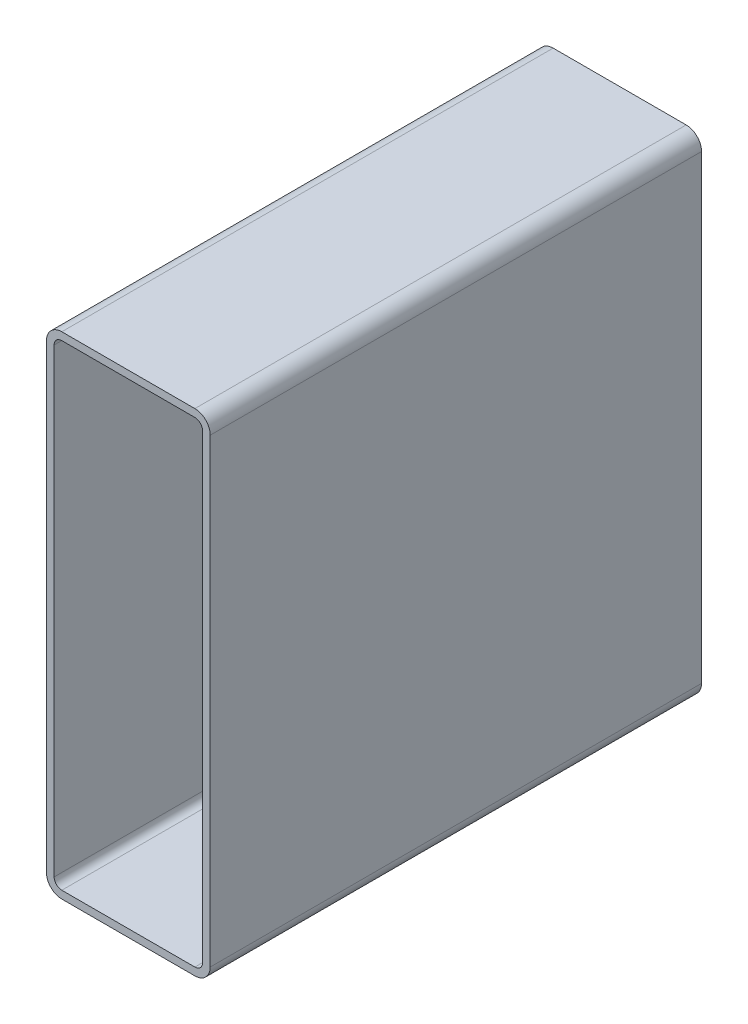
ISO-10303-21;
HEADER;
FILE_DESCRIPTION(('STEP AP214'),'2;1');
FILE_NAME('part.step','',(''),(''),'','','');
FILE_SCHEMA(('AUTOMOTIVE_DESIGN { 1 0 10303 214 1 1 1 1 }'));
ENDSEC;
DATA;
#1=APPLICATION_CONTEXT('core data for automotive mechanical design processes');
#2=APPLICATION_PROTOCOL_DEFINITION('international standard','automotive_design',2000,#1);
#3=PRODUCT_CONTEXT('',#1,'mechanical');
#4=PRODUCT('Part','Part','',(#3));
#5=PRODUCT_RELATED_PRODUCT_CATEGORY('part','',(#4));
#6=PRODUCT_DEFINITION_FORMATION('','',#4);
#7=PRODUCT_DEFINITION_CONTEXT('part definition',#1,'design');
#8=PRODUCT_DEFINITION('design','',#6,#7);
#9=PRODUCT_DEFINITION_SHAPE('','',#8);
#10=(LENGTH_UNIT() NAMED_UNIT(*) SI_UNIT(.MILLI.,.METRE.));
#11=(NAMED_UNIT(*) PLANE_ANGLE_UNIT() SI_UNIT($,.RADIAN.));
#12=(NAMED_UNIT(*) SI_UNIT($,.STERADIAN.) SOLID_ANGLE_UNIT());
#13=UNCERTAINTY_MEASURE_WITH_UNIT(LENGTH_MEASURE(1.E-05),#10,'distance_accuracy_value','');
#14=(GEOMETRIC_REPRESENTATION_CONTEXT(3) GLOBAL_UNCERTAINTY_ASSIGNED_CONTEXT((#13)) GLOBAL_UNIT_ASSIGNED_CONTEXT((#10,
#11,#12)) REPRESENTATION_CONTEXT('',''));
#15=CARTESIAN_POINT('',(0.,0.,0.));
#16=DIRECTION('',(0.,0.,1.));
#17=DIRECTION('',(1.,0.,0.));
#18=AXIS2_PLACEMENT_3D('',#15,#16,#17);
#19=CARTESIAN_POINT('',(11.2001778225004,297.149496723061,304.8));
#20=DIRECTION('',(0.,0.,1.));
#21=DIRECTION('',(1.,0.,0.));
#22=AXIS2_PLACEMENT_3D('',#19,#20,#21);
#23=PLANE('',#22);
#24=CARTESIAN_POINT('',(11.2001778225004,297.149496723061,304.8));
#25=DIRECTION('',(0.,0.,1.));
#26=DIRECTION('',(1.,0.,0.));
#27=AXIS2_PLACEMENT_3D('',#24,#25,#26);
#28=CIRCLE('',#27,9.52500000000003);
#29=CARTESIAN_POINT('',(11.2001778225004,306.674496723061,304.8));
#30=VERTEX_POINT('',#29);
#31=CARTESIAN_POINT('',(1.67517782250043,297.149496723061,304.8));
#32=VERTEX_POINT('',#31);
#33=EDGE_CURVE('E211',#30,#32,#28,.T.);
#34=ORIENTED_EDGE('',*,*,#33,.T.);
#35=DIRECTION('',(0.,-1.,0.));
#36=VECTOR('',#35,1.);
#37=CARTESIAN_POINT('',(1.67517782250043,11.3994967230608,304.8));
#38=LINE('',#37,#36);
#39=CARTESIAN_POINT('',(1.67517782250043,11.3994967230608,304.8));
#40=VERTEX_POINT('',#39);
#41=EDGE_CURVE('E214',#32,#40,#38,.T.);
#42=ORIENTED_EDGE('',*,*,#41,.T.);
#43=CARTESIAN_POINT('',(11.2001778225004,11.3994967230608,304.8));
#44=DIRECTION('',(0.,0.,1.));
#45=DIRECTION('',(1.,0.,0.));
#46=AXIS2_PLACEMENT_3D('',#43,#44,#45);
#47=CIRCLE('',#46,9.525);
#48=CARTESIAN_POINT('',(11.2001778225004,1.87449672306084,304.8));
#49=VERTEX_POINT('',#48);
#50=EDGE_CURVE('E217',#40,#49,#47,.T.);
#51=ORIENTED_EDGE('',*,*,#50,.T.);
#52=DIRECTION('',(1.,0.,0.));
#53=VECTOR('',#52,1.);
#54=CARTESIAN_POINT('',(93.7501778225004,1.87449672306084,304.8));
#55=LINE('',#54,#53);
#56=CARTESIAN_POINT('',(93.7501778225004,1.87449672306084,304.8));
#57=VERTEX_POINT('',#56);
#58=EDGE_CURVE('E219',#49,#57,#55,.T.);
#59=ORIENTED_EDGE('',*,*,#58,.T.);
#60=CARTESIAN_POINT('',(93.7501778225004,11.3994967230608,304.8));
#61=DIRECTION('',(0.,0.,1.));
#62=DIRECTION('',(1.,0.,0.));
#63=AXIS2_PLACEMENT_3D('',#60,#61,#62);
#64=CIRCLE('',#63,9.52500000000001);
#65=CARTESIAN_POINT('',(103.2751778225,11.3994967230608,304.8));
#66=VERTEX_POINT('',#65);
#67=EDGE_CURVE('E221',#57,#66,#64,.T.);
#68=ORIENTED_EDGE('',*,*,#67,.T.);
#69=DIRECTION('',(0.,1.,0.));
#70=VECTOR('',#69,1.);
#71=CARTESIAN_POINT('',(103.2751778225,297.149496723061,304.8));
#72=LINE('',#71,#70);
#73=CARTESIAN_POINT('',(103.2751778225,297.149496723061,304.8));
#74=VERTEX_POINT('',#73);
#75=EDGE_CURVE('E223',#66,#74,#72,.T.);
#76=ORIENTED_EDGE('',*,*,#75,.T.);
#77=CARTESIAN_POINT('',(93.7501778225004,297.149496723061,304.8));
#78=DIRECTION('',(0.,0.,1.));
#79=DIRECTION('',(1.,0.,0.));
#80=AXIS2_PLACEMENT_3D('',#77,#78,#79);
#81=CIRCLE('',#80,9.52500000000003);
#82=CARTESIAN_POINT('',(93.7501778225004,306.674496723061,304.8));
#83=VERTEX_POINT('',#82);
#84=EDGE_CURVE('E225',#74,#83,#81,.T.);
#85=ORIENTED_EDGE('',*,*,#84,.T.);
#86=DIRECTION('',(-1.,0.,0.));
#87=VECTOR('',#86,1.);
#88=CARTESIAN_POINT('',(11.2001778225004,306.674496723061,304.8));
#89=LINE('',#88,#87);
#90=EDGE_CURVE('E227',#83,#30,#89,.T.);
#91=ORIENTED_EDGE('',*,*,#90,.T.);
#92=EDGE_LOOP('',(#34,#42,#51,#59,#68,#76,#85,#91));
#93=FACE_BOUND('',#92,.T.);
#94=DIRECTION('',(0.,-1.,0.));
#95=VECTOR('',#94,1.);
#96=CARTESIAN_POINT('',(6.43767782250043,11.3994967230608,304.8));
#97=LINE('',#96,#95);
#98=CARTESIAN_POINT('',(6.43767782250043,297.149496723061,304.8));
#99=VERTEX_POINT('',#98);
#100=CARTESIAN_POINT('',(6.43767782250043,11.3994967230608,304.8));
#101=VERTEX_POINT('',#100);
#102=EDGE_CURVE('E154',#99,#101,#97,.T.);
#103=ORIENTED_EDGE('',*,*,#102,.F.);
#104=CARTESIAN_POINT('',(11.2001778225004,297.149496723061,304.8));
#105=DIRECTION('',(0.,0.,1.));
#106=DIRECTION('',(1.,0.,0.));
#107=AXIS2_PLACEMENT_3D('',#104,#105,#106);
#108=CIRCLE('',#107,4.76250000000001);
#109=CARTESIAN_POINT('',(11.2001778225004,301.911996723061,304.8));
#110=VERTEX_POINT('',#109);
#111=EDGE_CURVE('E146',#110,#99,#108,.T.);
#112=ORIENTED_EDGE('',*,*,#111,.F.);
#113=DIRECTION('',(-1.,0.,0.));
#114=VECTOR('',#113,1.);
#115=CARTESIAN_POINT('',(11.2001778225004,301.911996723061,304.8));
#116=LINE('',#115,#114);
#117=CARTESIAN_POINT('',(93.7501778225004,301.911996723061,304.8));
#118=VERTEX_POINT('',#117);
#119=EDGE_CURVE('E179',#118,#110,#116,.T.);
#120=ORIENTED_EDGE('',*,*,#119,.F.);
#121=CARTESIAN_POINT('',(93.7501778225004,297.149496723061,304.8));
#122=DIRECTION('',(0.,0.,1.));
#123=DIRECTION('',(1.,0.,0.));
#124=AXIS2_PLACEMENT_3D('',#121,#122,#123);
#125=CIRCLE('',#124,4.7625);
#126=CARTESIAN_POINT('',(98.5126778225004,297.149496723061,304.8));
#127=VERTEX_POINT('',#126);
#128=EDGE_CURVE('E177',#127,#118,#125,.T.);
#129=ORIENTED_EDGE('',*,*,#128,.F.);
#130=DIRECTION('',(0.,1.,0.));
#131=VECTOR('',#130,1.);
#132=CARTESIAN_POINT('',(98.5126778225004,297.149496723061,304.8));
#133=LINE('',#132,#131);
#134=CARTESIAN_POINT('',(98.5126778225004,11.3994967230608,304.8));
#135=VERTEX_POINT('',#134);
#136=EDGE_CURVE('E175',#135,#127,#133,.T.);
#137=ORIENTED_EDGE('',*,*,#136,.F.);
#138=CARTESIAN_POINT('',(93.7501778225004,11.3994967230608,304.8));
#139=DIRECTION('',(0.,0.,1.));
#140=DIRECTION('',(1.,0.,0.));
#141=AXIS2_PLACEMENT_3D('',#138,#139,#140);
#142=CIRCLE('',#141,4.7625);
#143=CARTESIAN_POINT('',(93.7501778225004,6.63699672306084,304.8));
#144=VERTEX_POINT('',#143);
#145=EDGE_CURVE('E173',#144,#135,#142,.T.);
#146=ORIENTED_EDGE('',*,*,#145,.F.);
#147=DIRECTION('',(1.,0.,0.));
#148=VECTOR('',#147,1.);
#149=CARTESIAN_POINT('',(93.7501778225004,6.63699672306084,304.8));
#150=LINE('',#149,#148);
#151=CARTESIAN_POINT('',(11.2001778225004,6.63699672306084,304.8));
#152=VERTEX_POINT('',#151);
#153=EDGE_CURVE('E169',#152,#144,#150,.T.);
#154=ORIENTED_EDGE('',*,*,#153,.F.);
#155=CARTESIAN_POINT('',(11.2001778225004,11.3994967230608,304.8));
#156=DIRECTION('',(0.,0.,1.));
#157=DIRECTION('',(1.,0.,0.));
#158=AXIS2_PLACEMENT_3D('',#155,#156,#157);
#159=CIRCLE('',#158,4.7625);
#160=EDGE_CURVE('E167',#101,#152,#159,.T.);
#161=ORIENTED_EDGE('',*,*,#160,.F.);
#162=EDGE_LOOP('',(#103,#112,#120,#129,#137,#146,#154,#161));
#163=FACE_BOUND('',#162,.T.);
#164=ADVANCED_FACE('F33',(#93,#163),#23,.T.);
#165=CARTESIAN_POINT('',(11.2001778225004,297.149496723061,0.));
#166=DIRECTION('',(0.,0.,1.));
#167=DIRECTION('',(1.,0.,0.));
#168=AXIS2_PLACEMENT_3D('',#165,#166,#167);
#169=PLANE('',#168);
#170=CARTESIAN_POINT('',(11.2001778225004,297.149496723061,0.));
#171=DIRECTION('',(0.,0.,1.));
#172=DIRECTION('',(1.,0.,0.));
#173=AXIS2_PLACEMENT_3D('',#170,#171,#172);
#174=CIRCLE('',#173,9.52500000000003);
#175=CARTESIAN_POINT('',(11.2001778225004,306.674496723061,0.));
#176=VERTEX_POINT('',#175);
#177=CARTESIAN_POINT('',(1.67517782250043,297.149496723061,0.));
#178=VERTEX_POINT('',#177);
#179=EDGE_CURVE('E162',#176,#178,#174,.T.);
#180=ORIENTED_EDGE('',*,*,#179,.F.);
#181=DIRECTION('',(-1.,0.,0.));
#182=VECTOR('',#181,1.);
#183=CARTESIAN_POINT('',(11.2001778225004,306.674496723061,0.));
#184=LINE('',#183,#182);
#185=CARTESIAN_POINT('',(93.7501778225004,306.674496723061,0.));
#186=VERTEX_POINT('',#185);
#187=EDGE_CURVE('E215',#186,#176,#184,.T.);
#188=ORIENTED_EDGE('',*,*,#187,.F.);
#189=CARTESIAN_POINT('',(93.7501778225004,297.149496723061,0.));
#190=DIRECTION('',(0.,0.,1.));
#191=DIRECTION('',(1.,0.,0.));
#192=AXIS2_PLACEMENT_3D('',#189,#190,#191);
#193=CIRCLE('',#192,9.52500000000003);
#194=CARTESIAN_POINT('',(103.2751778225,297.149496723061,0.));
#195=VERTEX_POINT('',#194);
#196=EDGE_CURVE('E242',#195,#186,#193,.T.);
#197=ORIENTED_EDGE('',*,*,#196,.F.);
#198=DIRECTION('',(0.,1.,0.));
#199=VECTOR('',#198,1.);
#200=CARTESIAN_POINT('',(103.2751778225,297.149496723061,0.));
#201=LINE('',#200,#199);
#202=CARTESIAN_POINT('',(103.2751778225,11.3994967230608,0.));
#203=VERTEX_POINT('',#202);
#204=EDGE_CURVE('E240',#203,#195,#201,.T.);
#205=ORIENTED_EDGE('',*,*,#204,.F.);
#206=CARTESIAN_POINT('',(93.7501778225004,11.3994967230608,0.));
#207=DIRECTION('',(0.,0.,1.));
#208=DIRECTION('',(1.,0.,0.));
#209=AXIS2_PLACEMENT_3D('',#206,#207,#208);
#210=CIRCLE('',#209,9.52500000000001);
#211=CARTESIAN_POINT('',(93.7501778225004,1.87449672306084,0.));
#212=VERTEX_POINT('',#211);
#213=EDGE_CURVE('E238',#212,#203,#210,.T.);
#214=ORIENTED_EDGE('',*,*,#213,.F.);
#215=DIRECTION('',(1.,0.,0.));
#216=VECTOR('',#215,1.);
#217=CARTESIAN_POINT('',(93.7501778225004,1.87449672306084,0.));
#218=LINE('',#217,#216);
#219=CARTESIAN_POINT('',(11.2001778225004,1.87449672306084,0.));
#220=VERTEX_POINT('',#219);
#221=EDGE_CURVE('E236',#220,#212,#218,.T.);
#222=ORIENTED_EDGE('',*,*,#221,.F.);
#223=CARTESIAN_POINT('',(11.2001778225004,11.3994967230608,0.));
#224=DIRECTION('',(0.,0.,1.));
#225=DIRECTION('',(1.,0.,0.));
#226=AXIS2_PLACEMENT_3D('',#223,#224,#225);
#227=CIRCLE('',#226,9.525);
#228=CARTESIAN_POINT('',(1.67517782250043,11.3994967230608,0.));
#229=VERTEX_POINT('',#228);
#230=EDGE_CURVE('E234',#229,#220,#227,.T.);
#231=ORIENTED_EDGE('',*,*,#230,.F.);
#232=DIRECTION('',(0.,-1.,0.));
#233=VECTOR('',#232,1.);
#234=CARTESIAN_POINT('',(1.67517782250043,11.3994967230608,0.));
#235=LINE('',#234,#233);
#236=EDGE_CURVE('E232',#178,#229,#235,.T.);
#237=ORIENTED_EDGE('',*,*,#236,.F.);
#238=EDGE_LOOP('',(#180,#188,#197,#205,#214,#222,#231,#237));
#239=FACE_BOUND('',#238,.T.);
#240=CARTESIAN_POINT('',(11.2001778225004,297.149496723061,0.));
#241=DIRECTION('',(0.,0.,1.));
#242=DIRECTION('',(1.,0.,0.));
#243=AXIS2_PLACEMENT_3D('',#240,#241,#242);
#244=CIRCLE('',#243,4.76250000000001);
#245=CARTESIAN_POINT('',(11.2001778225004,301.911996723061,0.));
#246=VERTEX_POINT('',#245);
#247=CARTESIAN_POINT('',(6.43767782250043,297.149496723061,0.));
#248=VERTEX_POINT('',#247);
#249=EDGE_CURVE('E56',#246,#248,#244,.T.);
#250=ORIENTED_EDGE('',*,*,#249,.T.);
#251=DIRECTION('',(0.,-1.,0.));
#252=VECTOR('',#251,1.);
#253=CARTESIAN_POINT('',(6.43767782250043,11.3994967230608,0.));
#254=LINE('',#253,#252);
#255=CARTESIAN_POINT('',(6.43767782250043,11.3994967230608,0.));
#256=VERTEX_POINT('',#255);
#257=EDGE_CURVE('E161',#248,#256,#254,.T.);
#258=ORIENTED_EDGE('',*,*,#257,.T.);
#259=CARTESIAN_POINT('',(11.2001778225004,11.3994967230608,0.));
#260=DIRECTION('',(0.,0.,1.));
#261=DIRECTION('',(1.,0.,0.));
#262=AXIS2_PLACEMENT_3D('',#259,#260,#261);
#263=CIRCLE('',#262,4.7625);
#264=CARTESIAN_POINT('',(11.2001778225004,6.63699672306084,0.));
#265=VERTEX_POINT('',#264);
#266=EDGE_CURVE('E183',#256,#265,#263,.T.);
#267=ORIENTED_EDGE('',*,*,#266,.T.);
#268=DIRECTION('',(1.,0.,0.));
#269=VECTOR('',#268,1.);
#270=CARTESIAN_POINT('',(93.7501778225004,6.63699672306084,0.));
#271=LINE('',#270,#269);
#272=CARTESIAN_POINT('',(93.7501778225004,6.63699672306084,0.));
#273=VERTEX_POINT('',#272);
#274=EDGE_CURVE('E186',#265,#273,#271,.T.);
#275=ORIENTED_EDGE('',*,*,#274,.T.);
#276=CARTESIAN_POINT('',(93.7501778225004,11.3994967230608,0.));
#277=DIRECTION('',(0.,0.,1.));
#278=DIRECTION('',(1.,0.,0.));
#279=AXIS2_PLACEMENT_3D('',#276,#277,#278);
#280=CIRCLE('',#279,4.7625);
#281=CARTESIAN_POINT('',(98.5126778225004,11.3994967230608,0.));
#282=VERTEX_POINT('',#281);
#283=EDGE_CURVE('E189',#273,#282,#280,.T.);
#284=ORIENTED_EDGE('',*,*,#283,.T.);
#285=DIRECTION('',(0.,1.,0.));
#286=VECTOR('',#285,1.);
#287=CARTESIAN_POINT('',(98.5126778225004,297.149496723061,0.));
#288=LINE('',#287,#286);
#289=CARTESIAN_POINT('',(98.5126778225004,297.149496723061,0.));
#290=VERTEX_POINT('',#289);
#291=EDGE_CURVE('E192',#282,#290,#288,.T.);
#292=ORIENTED_EDGE('',*,*,#291,.T.);
#293=CARTESIAN_POINT('',(93.7501778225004,297.149496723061,0.));
#294=DIRECTION('',(0.,0.,1.));
#295=DIRECTION('',(1.,0.,0.));
#296=AXIS2_PLACEMENT_3D('',#293,#294,#295);
#297=CIRCLE('',#296,4.7625);
#298=CARTESIAN_POINT('',(93.7501778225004,301.911996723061,0.));
#299=VERTEX_POINT('',#298);
#300=EDGE_CURVE('E195',#290,#299,#297,.T.);
#301=ORIENTED_EDGE('',*,*,#300,.T.);
#302=DIRECTION('',(-1.,0.,0.));
#303=VECTOR('',#302,1.);
#304=CARTESIAN_POINT('',(11.2001778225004,301.911996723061,0.));
#305=LINE('',#304,#303);
#306=EDGE_CURVE('E155',#299,#246,#305,.T.);
#307=ORIENTED_EDGE('',*,*,#306,.T.);
#308=EDGE_LOOP('',(#250,#258,#267,#275,#284,#292,#301,#307));
#309=FACE_BOUND('',#308,.T.);
#310=ADVANCED_FACE('F272',(#239,#309),#169,.F.);
#311=CARTESIAN_POINT('',(11.2001778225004,297.149496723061,304.8));
#312=DIRECTION('',(0.,0.,-1.));
#313=DIRECTION('',(-1.,0.,0.));
#314=AXIS2_PLACEMENT_3D('',#311,#312,#313);
#315=CYLINDRICAL_SURFACE('',#314,9.52500000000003);
#316=ORIENTED_EDGE('',*,*,#179,.T.);
#317=DIRECTION('',(0.,0.,-1.));
#318=VECTOR('',#317,1.);
#319=CARTESIAN_POINT('',(1.67517782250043,297.149496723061,304.8));
#320=LINE('',#319,#318);
#321=EDGE_CURVE('E11',#32,#178,#320,.T.);
#322=ORIENTED_EDGE('',*,*,#321,.F.);
#323=ORIENTED_EDGE('',*,*,#33,.F.);
#324=DIRECTION('',(0.,0.,-1.));
#325=VECTOR('',#324,1.);
#326=CARTESIAN_POINT('',(11.2001778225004,306.674496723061,304.8));
#327=LINE('',#326,#325);
#328=EDGE_CURVE('E229',#30,#176,#327,.T.);
#329=ORIENTED_EDGE('',*,*,#328,.T.);
#330=EDGE_LOOP('',(#316,#322,#323,#329));
#331=FACE_BOUND('',#330,.T.);
#332=ADVANCED_FACE('F35',(#331),#315,.T.);
#333=CARTESIAN_POINT('',(1.67517782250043,11.3994967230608,304.8));
#334=DIRECTION('',(1.,0.,0.));
#335=DIRECTION('',(0.,0.,-1.));
#336=AXIS2_PLACEMENT_3D('',#333,#334,#335);
#337=PLANE('',#336);
#338=ORIENTED_EDGE('',*,*,#236,.T.);
#339=DIRECTION('',(0.,0.,-1.));
#340=VECTOR('',#339,1.);
#341=CARTESIAN_POINT('',(1.67517782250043,11.3994967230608,304.8));
#342=LINE('',#341,#340);
#343=EDGE_CURVE('E41',#40,#229,#342,.T.);
#344=ORIENTED_EDGE('',*,*,#343,.F.);
#345=ORIENTED_EDGE('',*,*,#41,.F.);
#346=ORIENTED_EDGE('',*,*,#321,.T.);
#347=EDGE_LOOP('',(#338,#344,#345,#346));
#348=FACE_BOUND('',#347,.T.);
#349=ADVANCED_FACE('F289',(#348),#337,.F.);
#350=CARTESIAN_POINT('',(11.2001778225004,11.3994967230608,304.8));
#351=DIRECTION('',(0.,0.,-1.));
#352=DIRECTION('',(-1.,0.,0.));
#353=AXIS2_PLACEMENT_3D('',#350,#351,#352);
#354=CYLINDRICAL_SURFACE('',#353,9.525);
#355=ORIENTED_EDGE('',*,*,#230,.T.);
#356=DIRECTION('',(0.,0.,-1.));
#357=VECTOR('',#356,1.);
#358=CARTESIAN_POINT('',(11.2001778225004,1.87449672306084,304.8));
#359=LINE('',#358,#357);
#360=EDGE_CURVE('E259',#49,#220,#359,.T.);
#361=ORIENTED_EDGE('',*,*,#360,.F.);
#362=ORIENTED_EDGE('',*,*,#50,.F.);
#363=ORIENTED_EDGE('',*,*,#343,.T.);
#364=EDGE_LOOP('',(#355,#361,#362,#363));
#365=FACE_BOUND('',#364,.T.);
#366=ADVANCED_FACE('F266',(#365),#354,.T.);
#367=CARTESIAN_POINT('',(93.7501778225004,1.87449672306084,304.8));
#368=DIRECTION('',(0.,1.,0.));
#369=DIRECTION('',(0.,0.,1.));
#370=AXIS2_PLACEMENT_3D('',#367,#368,#369);
#371=PLANE('',#370);
#372=ORIENTED_EDGE('',*,*,#221,.T.);
#373=DIRECTION('',(0.,0.,-1.));
#374=VECTOR('',#373,1.);
#375=CARTESIAN_POINT('',(93.7501778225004,1.87449672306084,304.8));
#376=LINE('',#375,#374);
#377=EDGE_CURVE('E256',#57,#212,#376,.T.);
#378=ORIENTED_EDGE('',*,*,#377,.F.);
#379=ORIENTED_EDGE('',*,*,#58,.F.);
#380=ORIENTED_EDGE('',*,*,#360,.T.);
#381=EDGE_LOOP('',(#372,#378,#379,#380));
#382=FACE_BOUND('',#381,.T.);
#383=ADVANCED_FACE('F278',(#382),#371,.F.);
#384=CARTESIAN_POINT('',(93.7501778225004,11.3994967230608,304.8));
#385=DIRECTION('',(0.,0.,-1.));
#386=DIRECTION('',(-1.,0.,0.));
#387=AXIS2_PLACEMENT_3D('',#384,#385,#386);
#388=CYLINDRICAL_SURFACE('',#387,9.52500000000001);
#389=ORIENTED_EDGE('',*,*,#213,.T.);
#390=DIRECTION('',(0.,0.,-1.));
#391=VECTOR('',#390,1.);
#392=CARTESIAN_POINT('',(103.2751778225,11.3994967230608,304.8));
#393=LINE('',#392,#391);
#394=EDGE_CURVE('E253',#66,#203,#393,.T.);
#395=ORIENTED_EDGE('',*,*,#394,.F.);
#396=ORIENTED_EDGE('',*,*,#67,.F.);
#397=ORIENTED_EDGE('',*,*,#377,.T.);
#398=EDGE_LOOP('',(#389,#395,#396,#397));
#399=FACE_BOUND('',#398,.T.);
#400=ADVANCED_FACE('F282',(#399),#388,.T.);
#401=CARTESIAN_POINT('',(103.2751778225,297.149496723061,304.8));
#402=DIRECTION('',(-1.,0.,0.));
#403=DIRECTION('',(0.,0.,1.));
#404=AXIS2_PLACEMENT_3D('',#401,#402,#403);
#405=PLANE('',#404);
#406=ORIENTED_EDGE('',*,*,#204,.T.);
#407=DIRECTION('',(0.,0.,-1.));
#408=VECTOR('',#407,1.);
#409=CARTESIAN_POINT('',(103.2751778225,297.149496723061,304.8));
#410=LINE('',#409,#408);
#411=EDGE_CURVE('E250',#74,#195,#410,.T.);
#412=ORIENTED_EDGE('',*,*,#411,.F.);
#413=ORIENTED_EDGE('',*,*,#75,.F.);
#414=ORIENTED_EDGE('',*,*,#394,.T.);
#415=EDGE_LOOP('',(#406,#412,#413,#414));
#416=FACE_BOUND('',#415,.T.);
#417=ADVANCED_FACE('F302',(#416),#405,.F.);
#418=CARTESIAN_POINT('',(93.7501778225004,297.149496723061,304.8));
#419=DIRECTION('',(0.,0.,-1.));
#420=DIRECTION('',(-1.,0.,0.));
#421=AXIS2_PLACEMENT_3D('',#418,#419,#420);
#422=CYLINDRICAL_SURFACE('',#421,9.52500000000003);
#423=ORIENTED_EDGE('',*,*,#196,.T.);
#424=DIRECTION('',(0.,0.,-1.));
#425=VECTOR('',#424,1.);
#426=CARTESIAN_POINT('',(93.7501778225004,306.674496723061,304.8));
#427=LINE('',#426,#425);
#428=EDGE_CURVE('E247',#83,#186,#427,.T.);
#429=ORIENTED_EDGE('',*,*,#428,.F.);
#430=ORIENTED_EDGE('',*,*,#84,.F.);
#431=ORIENTED_EDGE('',*,*,#411,.T.);
#432=EDGE_LOOP('',(#423,#429,#430,#431));
#433=FACE_BOUND('',#432,.T.);
#434=ADVANCED_FACE('F300',(#433),#422,.T.);
#435=CARTESIAN_POINT('',(11.2001778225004,306.674496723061,304.8));
#436=DIRECTION('',(0.,-1.,0.));
#437=DIRECTION('',(0.,0.,-1.));
#438=AXIS2_PLACEMENT_3D('',#435,#436,#437);
#439=PLANE('',#438);
#440=ORIENTED_EDGE('',*,*,#187,.T.);
#441=ORIENTED_EDGE('',*,*,#328,.F.);
#442=ORIENTED_EDGE('',*,*,#90,.F.);
#443=ORIENTED_EDGE('',*,*,#428,.T.);
#444=EDGE_LOOP('',(#440,#441,#442,#443));
#445=FACE_BOUND('',#444,.T.);
#446=ADVANCED_FACE('F295',(#445),#439,.F.);
#447=CARTESIAN_POINT('',(11.2001778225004,297.149496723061,304.8));
#448=DIRECTION('',(0.,0.,-1.));
#449=DIRECTION('',(-1.,0.,0.));
#450=AXIS2_PLACEMENT_3D('',#447,#448,#449);
#451=CYLINDRICAL_SURFACE('',#450,4.76250000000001);
#452=ORIENTED_EDGE('',*,*,#249,.F.);
#453=DIRECTION('',(0.,0.,-1.));
#454=VECTOR('',#453,1.);
#455=CARTESIAN_POINT('',(11.2001778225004,301.911996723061,304.8));
#456=LINE('',#455,#454);
#457=EDGE_CURVE('E150',#110,#246,#456,.T.);
#458=ORIENTED_EDGE('',*,*,#457,.F.);
#459=ORIENTED_EDGE('',*,*,#111,.T.);
#460=DIRECTION('',(0.,0.,-1.));
#461=VECTOR('',#460,1.);
#462=CARTESIAN_POINT('',(6.43767782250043,297.149496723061,304.8));
#463=LINE('',#462,#461);
#464=EDGE_CURVE('E149',#99,#248,#463,.T.);
#465=ORIENTED_EDGE('',*,*,#464,.T.);
#466=EDGE_LOOP('',(#452,#458,#459,#465));
#467=FACE_BOUND('',#466,.T.);
#468=ADVANCED_FACE('F148',(#467),#451,.F.);
#469=CARTESIAN_POINT('',(6.43767782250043,11.3994967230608,304.8));
#470=DIRECTION('',(1.,0.,0.));
#471=DIRECTION('',(0.,0.,-1.));
#472=AXIS2_PLACEMENT_3D('',#469,#470,#471);
#473=PLANE('',#472);
#474=ORIENTED_EDGE('',*,*,#257,.F.);
#475=ORIENTED_EDGE('',*,*,#464,.F.);
#476=ORIENTED_EDGE('',*,*,#102,.T.);
#477=DIRECTION('',(0.,0.,-1.));
#478=VECTOR('',#477,1.);
#479=CARTESIAN_POINT('',(6.43767782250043,11.3994967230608,304.8));
#480=LINE('',#479,#478);
#481=EDGE_CURVE('E163',#101,#256,#480,.T.);
#482=ORIENTED_EDGE('',*,*,#481,.T.);
#483=EDGE_LOOP('',(#474,#475,#476,#482));
#484=FACE_BOUND('',#483,.T.);
#485=ADVANCED_FACE('F158',(#484),#473,.T.);
#486=CARTESIAN_POINT('',(11.2001778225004,11.3994967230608,304.8));
#487=DIRECTION('',(0.,0.,-1.));
#488=DIRECTION('',(-1.,0.,0.));
#489=AXIS2_PLACEMENT_3D('',#486,#487,#488);
#490=CYLINDRICAL_SURFACE('',#489,4.7625);
#491=ORIENTED_EDGE('',*,*,#266,.F.);
#492=ORIENTED_EDGE('',*,*,#481,.F.);
#493=ORIENTED_EDGE('',*,*,#160,.T.);
#494=DIRECTION('',(0.,0.,-1.));
#495=VECTOR('',#494,1.);
#496=CARTESIAN_POINT('',(11.2001778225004,6.63699672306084,304.8));
#497=LINE('',#496,#495);
#498=EDGE_CURVE('E208',#152,#265,#497,.T.);
#499=ORIENTED_EDGE('',*,*,#498,.T.);
#500=EDGE_LOOP('',(#491,#492,#493,#499));
#501=FACE_BOUND('',#500,.T.);
#502=ADVANCED_FACE('F327',(#501),#490,.F.);
#503=CARTESIAN_POINT('',(93.7501778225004,6.63699672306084,304.8));
#504=DIRECTION('',(0.,1.,0.));
#505=DIRECTION('',(0.,0.,1.));
#506=AXIS2_PLACEMENT_3D('',#503,#504,#505);
#507=PLANE('',#506);
#508=ORIENTED_EDGE('',*,*,#274,.F.);
#509=ORIENTED_EDGE('',*,*,#498,.F.);
#510=ORIENTED_EDGE('',*,*,#153,.T.);
#511=DIRECTION('',(0.,0.,-1.));
#512=VECTOR('',#511,1.);
#513=CARTESIAN_POINT('',(93.7501778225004,6.63699672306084,304.8));
#514=LINE('',#513,#512);
#515=EDGE_CURVE('E206',#144,#273,#514,.T.);
#516=ORIENTED_EDGE('',*,*,#515,.T.);
#517=EDGE_LOOP('',(#508,#509,#510,#516));
#518=FACE_BOUND('',#517,.T.);
#519=ADVANCED_FACE('F331',(#518),#507,.T.);
#520=CARTESIAN_POINT('',(93.7501778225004,11.3994967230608,304.8));
#521=DIRECTION('',(0.,0.,-1.));
#522=DIRECTION('',(-1.,0.,0.));
#523=AXIS2_PLACEMENT_3D('',#520,#521,#522);
#524=CYLINDRICAL_SURFACE('',#523,4.7625);
#525=ORIENTED_EDGE('',*,*,#283,.F.);
#526=ORIENTED_EDGE('',*,*,#515,.F.);
#527=ORIENTED_EDGE('',*,*,#145,.T.);
#528=DIRECTION('',(0.,0.,-1.));
#529=VECTOR('',#528,1.);
#530=CARTESIAN_POINT('',(98.5126778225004,11.3994967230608,304.8));
#531=LINE('',#530,#529);
#532=EDGE_CURVE('E204',#135,#282,#531,.T.);
#533=ORIENTED_EDGE('',*,*,#532,.T.);
#534=EDGE_LOOP('',(#525,#526,#527,#533));
#535=FACE_BOUND('',#534,.T.);
#536=ADVANCED_FACE('F337',(#535),#524,.F.);
#537=CARTESIAN_POINT('',(98.5126778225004,297.149496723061,304.8));
#538=DIRECTION('',(-1.,0.,0.));
#539=DIRECTION('',(0.,0.,1.));
#540=AXIS2_PLACEMENT_3D('',#537,#538,#539);
#541=PLANE('',#540);
#542=ORIENTED_EDGE('',*,*,#291,.F.);
#543=ORIENTED_EDGE('',*,*,#532,.F.);
#544=ORIENTED_EDGE('',*,*,#136,.T.);
#545=DIRECTION('',(0.,0.,-1.));
#546=VECTOR('',#545,1.);
#547=CARTESIAN_POINT('',(98.5126778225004,297.149496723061,304.8));
#548=LINE('',#547,#546);
#549=EDGE_CURVE('E202',#127,#290,#548,.T.);
#550=ORIENTED_EDGE('',*,*,#549,.T.);
#551=EDGE_LOOP('',(#542,#543,#544,#550));
#552=FACE_BOUND('',#551,.T.);
#553=ADVANCED_FACE('F341',(#552),#541,.T.);
#554=CARTESIAN_POINT('',(93.7501778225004,297.149496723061,304.8));
#555=DIRECTION('',(0.,0.,-1.));
#556=DIRECTION('',(-1.,0.,0.));
#557=AXIS2_PLACEMENT_3D('',#554,#555,#556);
#558=CYLINDRICAL_SURFACE('',#557,4.7625);
#559=ORIENTED_EDGE('',*,*,#300,.F.);
#560=ORIENTED_EDGE('',*,*,#549,.F.);
#561=ORIENTED_EDGE('',*,*,#128,.T.);
#562=DIRECTION('',(0.,0.,-1.));
#563=VECTOR('',#562,1.);
#564=CARTESIAN_POINT('',(93.7501778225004,301.911996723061,304.8));
#565=LINE('',#564,#563);
#566=EDGE_CURVE('E48',#118,#299,#565,.T.);
#567=ORIENTED_EDGE('',*,*,#566,.T.);
#568=EDGE_LOOP('',(#559,#560,#561,#567));
#569=FACE_BOUND('',#568,.T.);
#570=ADVANCED_FACE('F345',(#569),#558,.F.);
#571=CARTESIAN_POINT('',(11.2001778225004,301.911996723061,304.8));
#572=DIRECTION('',(0.,-1.,0.));
#573=DIRECTION('',(0.,0.,-1.));
#574=AXIS2_PLACEMENT_3D('',#571,#572,#573);
#575=PLANE('',#574);
#576=ORIENTED_EDGE('',*,*,#306,.F.);
#577=ORIENTED_EDGE('',*,*,#566,.F.);
#578=ORIENTED_EDGE('',*,*,#119,.T.);
#579=ORIENTED_EDGE('',*,*,#457,.T.);
#580=EDGE_LOOP('',(#576,#577,#578,#579));
#581=FACE_BOUND('',#580,.T.);
#582=ADVANCED_FACE('F349',(#581),#575,.T.);
#583=CLOSED_SHELL('',(#164,#310,#332,#349,#366,#383,#400,#417,#434,#446,#468,#485,#502,#519,
#536,#553,#570,#582));
#584=MANIFOLD_SOLID_BREP('B2',#583);
#585=ADVANCED_BREP_SHAPE_REPRESENTATION('',(#18,#584),#14);
#586=SHAPE_DEFINITION_REPRESENTATION(#9,#585);
ENDSEC;
END-ISO-10303-21;
